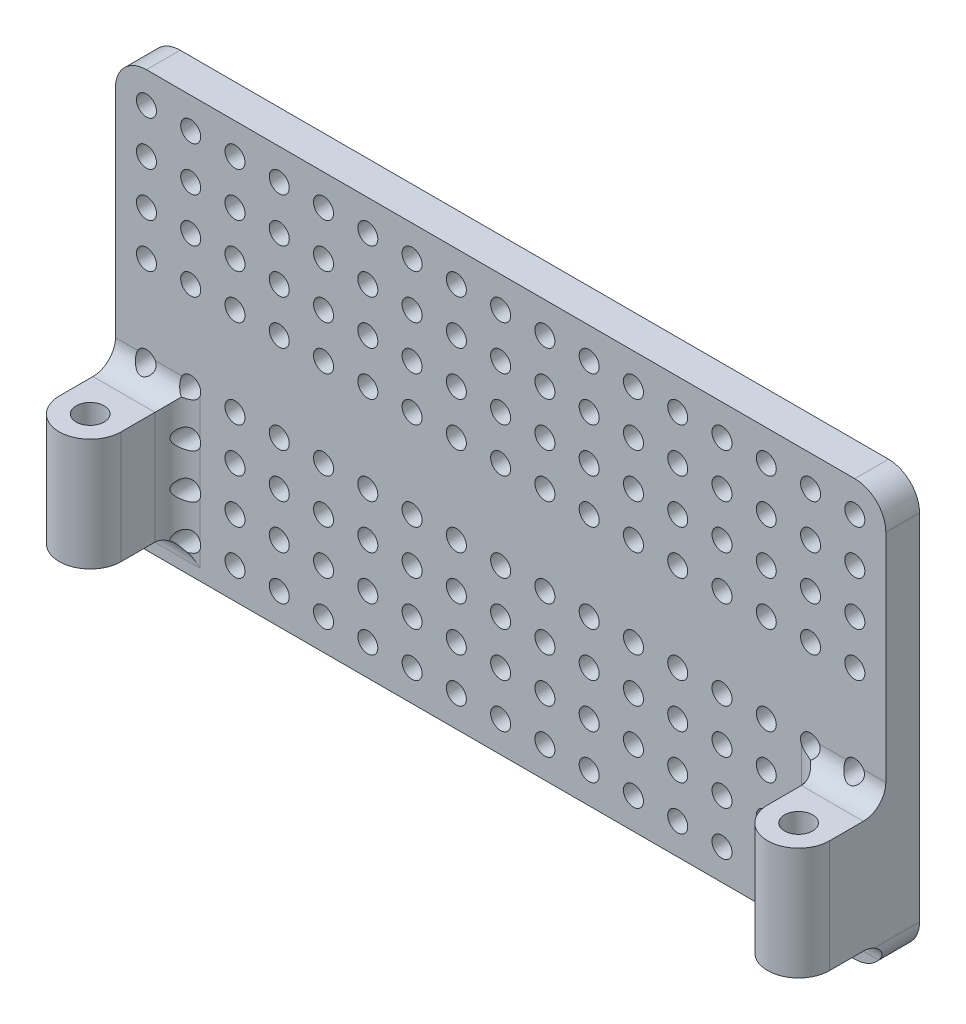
from build123d import *

# Parameters (mm, degrees)
SKETCH1_W                      = 87
SKETCH1_H                      = 47
BOSS_EXTRUDE1_DEPTH            = 1.905
BOSS_EXTRUDE2_DEPTH            = 12.7
F_1_8_0_125_DIAMETER_HOLE1_D   = 3.175
FILLET5_R                      = 2.54
FILLET7_R                      = 3.5
F_4_40_TAPPED_HOLE3_AT_2_COUNT = 2
F_4_40_TAPPED_HOLE3_AT_2_PITCH = 40
F_4_40_TAPPED_HOLE3_AT_3_COUNT = 2
F_4_40_TAPPED_HOLE3_AT_3_PITCH = 25
F_4_40_TAPPED_HOLE3_AT_4_COUNT = 2
F_4_40_TAPPED_HOLE3_AT_4_PITCH = 30
F_4_40_TAPPED_HOLE3_AT_5_COUNT = 2
F_4_40_TAPPED_HOLE3_AT_5_PITCH = 10
F_4_40_TAPPED_HOLE3_AT_6_COUNT = 2
F_4_40_TAPPED_HOLE3_AT_6_PITCH = 15
F_4_40_TAPPED_HOLE3_AT_7_COUNT = 2
F_4_40_TAPPED_HOLE3_AT_7_PITCH = 35
F_4_40_TAPPED_HOLE3_AT_8_COUNT = 2
F_4_40_TAPPED_HOLE3_AT_8_PITCH = 5
LPATTERN2_COUNT                = 17
LPATTERN2_PITCH                = 5


with BuildPart() as part:
    # Sketch1 → Boss-Extrude1 (new, symmetric)
    with BuildSketch(Plane.XY):
        Rectangle(SKETCH1_W, SKETCH1_H)
    extrude(amount=BOSS_EXTRUDE1_DEPTH, both=True)

    # Sketch2 → Boss-Extrude2 (add)
    with BuildSketch(Plane.XZ.offset(19.69)):
        with BuildLine():
            Line((-43.5, 8.255), (-43.5, 1.905))
            Line((-43.5, 1.905), (-36.5, 1.905))
            Line((-36.5, 1.905), (-36.5, 8.255))
            ThreePointArc((-36.5, 8.255), (-40, 11.755), (-43.5, 8.255))
        make_face()
        with BuildLine():
            Line((36.5, 1.905), (36.5, 8.255))
            ThreePointArc((36.5, 8.255), (40, 11.755), (43.5, 8.255))
            Line((43.5, 8.255), (43.5, 1.905))
            Line((43.5, 1.905), (36.5, 1.905))
        make_face()
    extrude(amount=-BOSS_EXTRUDE2_DEPTH)

    # 1_8 _0.125_ Diameter Hole1 (through all)
    with Locations(Plane(origin=(0, -19.69, 0), x_dir=(-1, 0, 0), z_dir=(0, -1, 0))):
        with Locations((40, -8.255), (-40, -8.255)):
            Hole(F_1_8_0_125_DIAMETER_HOLE1_D / 2)

    # Fillet5
    fillet5_edges = [part.edges().sort_by_distance(p)[0] for p in [
        (-40, -6.99, 1.905),
        (-36.5, -13.34, 1.905),
        (-40, -19.69, 1.905),
        (40, -6.99, 1.905),
        (36.5, -13.34, 1.905),
        (40, -19.69, 1.905),
    ]]
    fillet(fillet5_edges, radius=FILLET5_R)

    # Fillet7
    fillet7_edges = [part.edges().sort_by_distance(p)[0] for p in [
        (-43.5, 23.5, 0),
        (43.5, 23.5, 0),
        (43.5, -23.5, 0),
        (-43.5, -23.5, 0),
    ]]
    fillet(fillet7_edges, radius=FILLET7_R)

    # Sketch12 → 4-40 Tapped Hole3 (revolve, cut)
    with BuildSketch(Plane(origin=(40, 20, -1.905), x_dir=(0, 1, 0), z_dir=(1, 0, 0))):
        Polygon((0, 0), (0, 7.029152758), (1.1303, 6.35), (1.1303, 0), align=None)
    f_4_40_tapped_hole3 = revolve(axis=Axis((40, 20, -8.255), (0, 0, 1)), mode=Mode.SUBTRACT)

    # 4-40 Tapped Hole3 at 2: 4-40 Tapped Hole3 ×2
    with Locations(*[(0, -i * F_4_40_TAPPED_HOLE3_AT_2_PITCH, 0) for i in range(1, F_4_40_TAPPED_HOLE3_AT_2_COUNT)]):
        add(f_4_40_tapped_hole3, mode=Mode.SUBTRACT)

    # 4-40 Tapped Hole3 at 3: 4-40 Tapped Hole3 ×2
    with Locations(*[(0, -i * F_4_40_TAPPED_HOLE3_AT_3_PITCH, 0) for i in range(1, F_4_40_TAPPED_HOLE3_AT_3_COUNT)]):
        add(f_4_40_tapped_hole3, mode=Mode.SUBTRACT)

    # 4-40 Tapped Hole3 at 4: 4-40 Tapped Hole3 ×2
    with Locations(*[(0, -i * F_4_40_TAPPED_HOLE3_AT_4_PITCH, 0) for i in range(1, F_4_40_TAPPED_HOLE3_AT_4_COUNT)]):
        add(f_4_40_tapped_hole3, mode=Mode.SUBTRACT)

    # 4-40 Tapped Hole3 at 5: 4-40 Tapped Hole3 ×2
    with Locations(*[(0, -i * F_4_40_TAPPED_HOLE3_AT_5_PITCH, 0) for i in range(1, F_4_40_TAPPED_HOLE3_AT_5_COUNT)]):
        add(f_4_40_tapped_hole3, mode=Mode.SUBTRACT)

    # 4-40 Tapped Hole3 at 6: 4-40 Tapped Hole3 ×2
    with Locations(*[(0, -i * F_4_40_TAPPED_HOLE3_AT_6_PITCH, 0) for i in range(1, F_4_40_TAPPED_HOLE3_AT_6_COUNT)]):
        add(f_4_40_tapped_hole3, mode=Mode.SUBTRACT)

    # 4-40 Tapped Hole3 at 7: 4-40 Tapped Hole3 ×2
    with Locations(*[(0, -i * F_4_40_TAPPED_HOLE3_AT_7_PITCH, 0) for i in range(1, F_4_40_TAPPED_HOLE3_AT_7_COUNT)]):
        add(f_4_40_tapped_hole3, mode=Mode.SUBTRACT)

    # 4-40 Tapped Hole3 at 8: 4-40 Tapped Hole3 ×2
    with Locations(*[(0, -i * F_4_40_TAPPED_HOLE3_AT_8_PITCH, 0) for i in range(1, F_4_40_TAPPED_HOLE3_AT_8_COUNT)]):
        add(f_4_40_tapped_hole3, mode=Mode.SUBTRACT)

    # LPattern2: 4-40 Tapped Hole3 ×17
    with Locations(*[(-i * LPATTERN2_PITCH, 0, 0) for i in range(1, LPATTERN2_COUNT)]):
        add(f_4_40_tapped_hole3, mode=Mode.SUBTRACT)

    # LPattern2 copy 1 sketch → LPattern2 copy 1 (revolve, cut)
    with BuildSketch(Plane(origin=(35, -20, -1.905), x_dir=(0, 1, 0), z_dir=(1, 0, 0))):
        Polygon((0, 0), (0, 7.029152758), (1.1303, 6.35), (1.1303, 0), align=None)
    revolve(axis=Axis((35, -20, -8.255), (0, 0, 1)), mode=Mode.SUBTRACT)

    # LPattern2 copy 2 sketch → LPattern2 copy 2 (revolve, cut)
    with BuildSketch(Plane(origin=(30, -20, -1.905), x_dir=(0, 1, 0), z_dir=(1, 0, 0))):
        Polygon((0, 0), (0, 7.029152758), (1.1303, 6.35), (1.1303, 0), align=None)
    revolve(axis=Axis((30, -20, -8.255), (0, 0, 1)), mode=Mode.SUBTRACT)

    # LPattern2 copy 3 sketch → LPattern2 copy 3 (revolve, cut)
    with BuildSketch(Plane(origin=(25, -20, -1.905), x_dir=(0, 1, 0), z_dir=(1, 0, 0))):
        Polygon((0, 0), (0, 7.029152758), (1.1303, 6.35), (1.1303, 0), align=None)
    revolve(axis=Axis((25, -20, -8.255), (0, 0, 1)), mode=Mode.SUBTRACT)

    # LPattern2 copy 4 sketch → LPattern2 copy 4 (revolve, cut)
    with BuildSketch(Plane(origin=(20, -20, -1.905), x_dir=(0, 1, 0), z_dir=(1, 0, 0))):
        Polygon((0, 0), (0, 7.029152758), (1.1303, 6.35), (1.1303, 0), align=None)
    revolve(axis=Axis((20, -20, -8.255), (0, 0, 1)), mode=Mode.SUBTRACT)

    # LPattern2 copy 5 sketch → LPattern2 copy 5 (revolve, cut)
    with BuildSketch(Plane(origin=(15, -20, -1.905), x_dir=(0, 1, 0), z_dir=(1, 0, 0))):
        Polygon((0, 0), (0, 7.029152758), (1.1303, 6.35), (1.1303, 0), align=None)
    revolve(axis=Axis((15, -20, -8.255), (0, 0, 1)), mode=Mode.SUBTRACT)

    # LPattern2 copy 6 sketch → LPattern2 copy 6 (revolve, cut)
    with BuildSketch(Plane(origin=(10, -20, -1.905), x_dir=(0, 1, 0), z_dir=(1, 0, 0))):
        Polygon((0, 0), (0, 7.029152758), (1.1303, 6.35), (1.1303, 0), align=None)
    revolve(axis=Axis((10, -20, -8.255), (0, 0, 1)), mode=Mode.SUBTRACT)

    # LPattern2 copy 7 sketch → LPattern2 copy 7 (revolve, cut)
    with BuildSketch(Plane(origin=(5, -20, -1.905), x_dir=(0, 1, 0), z_dir=(1, 0, 0))):
        Polygon((0, 0), (0, 7.029152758), (1.1303, 6.35), (1.1303, 0), align=None)
    revolve(axis=Axis((5, -20, -8.255), (0, 0, 1)), mode=Mode.SUBTRACT)

    # LPattern2 copy 8 sketch → LPattern2 copy 8 (revolve, cut)
    with BuildSketch(Plane(origin=(0, -20, -1.905), x_dir=(0, 1, 0), z_dir=(1, 0, 0))):
        Polygon((0, 0), (0, 7.029152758), (1.1303, 6.35), (1.1303, 0), align=None)
    revolve(axis=Axis((0, -20, -8.255), (0, 0, 1)), mode=Mode.SUBTRACT)

    # LPattern2 copy 9 sketch → LPattern2 copy 9 (revolve, cut)
    with BuildSketch(Plane(origin=(-5, -20, -1.905), x_dir=(0, 1, 0), z_dir=(1, 0, 0))):
        Polygon((0, 0), (0, 7.029152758), (1.1303, 6.35), (1.1303, 0), align=None)
    revolve(axis=Axis((-5, -20, -8.255), (0, 0, 1)), mode=Mode.SUBTRACT)

    # LPattern2 copy 10 sketch → LPattern2 copy 10 (revolve, cut)
    with BuildSketch(Plane(origin=(-10, -20, -1.905), x_dir=(0, 1, 0), z_dir=(1, 0, 0))):
        Polygon((0, 0), (0, 7.029152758), (1.1303, 6.35), (1.1303, 0), align=None)
    revolve(axis=Axis((-10, -20, -8.255), (0, 0, 1)), mode=Mode.SUBTRACT)

    # LPattern2 copy 11 sketch → LPattern2 copy 11 (revolve, cut)
    with BuildSketch(Plane(origin=(-15, -20, -1.905), x_dir=(0, 1, 0), z_dir=(1, 0, 0))):
        Polygon((0, 0), (0, 7.029152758), (1.1303, 6.35), (1.1303, 0), align=None)
    revolve(axis=Axis((-15, -20, -8.255), (0, 0, 1)), mode=Mode.SUBTRACT)

    # LPattern2 copy 12 sketch → LPattern2 copy 12 (revolve, cut)
    with BuildSketch(Plane(origin=(-20, -20, -1.905), x_dir=(0, 1, 0), z_dir=(1, 0, 0))):
        Polygon((0, 0), (0, 7.029152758), (1.1303, 6.35), (1.1303, 0), align=None)
    revolve(axis=Axis((-20, -20, -8.255), (0, 0, 1)), mode=Mode.SUBTRACT)

    # LPattern2 copy 13 sketch → LPattern2 copy 13 (revolve, cut)
    with BuildSketch(Plane(origin=(-25, -20, -1.905), x_dir=(0, 1, 0), z_dir=(1, 0, 0))):
        Polygon((0, 0), (0, 7.029152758), (1.1303, 6.35), (1.1303, 0), align=None)
    revolve(axis=Axis((-25, -20, -8.255), (0, 0, 1)), mode=Mode.SUBTRACT)

    # LPattern2 copy 14 sketch → LPattern2 copy 14 (revolve, cut)
    with BuildSketch(Plane(origin=(-30, -20, -1.905), x_dir=(0, 1, 0), z_dir=(1, 0, 0))):
        Polygon((0, 0), (0, 7.029152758), (1.1303, 6.35), (1.1303, 0), align=None)
    revolve(axis=Axis((-30, -20, -8.255), (0, 0, 1)), mode=Mode.SUBTRACT)

    # LPattern2 copy 15 sketch → LPattern2 copy 15 (revolve, cut)
    with BuildSketch(Plane(origin=(-35, -20, -1.905), x_dir=(0, 1, 0), z_dir=(1, 0, 0))):
        Polygon((0, 0), (0, 7.029152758), (1.1303, 6.35), (1.1303, 0), align=None)
    revolve(axis=Axis((-35, -20, -8.255), (0, 0, 1)), mode=Mode.SUBTRACT)

    # LPattern2 copy 16 sketch → LPattern2 copy 16 (revolve, cut)
    with BuildSketch(Plane(origin=(-40, -20, -1.905), x_dir=(0, 1, 0), z_dir=(1, 0, 0))):
        Polygon((0, 0), (0, 7.029152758), (1.1303, 6.35), (1.1303, 0), align=None)
    revolve(axis=Axis((-40, -20, -8.255), (0, 0, 1)), mode=Mode.SUBTRACT)

    # LPattern2 copy 17 sketch → LPattern2 copy 17 (revolve, cut)
    with BuildSketch(Plane(origin=(35, -5, -1.905), x_dir=(0, 1, 0), z_dir=(1, 0, 0))):
        Polygon((0, 0), (0, 7.029152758), (1.1303, 6.35), (1.1303, 0), align=None)
    revolve(axis=Axis((35, -5, -8.255), (0, 0, 1)), mode=Mode.SUBTRACT)

    # LPattern2 copy 18 sketch → LPattern2 copy 18 (revolve, cut)
    with BuildSketch(Plane(origin=(30, -5, -1.905), x_dir=(0, 1, 0), z_dir=(1, 0, 0))):
        Polygon((0, 0), (0, 7.029152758), (1.1303, 6.35), (1.1303, 0), align=None)
    revolve(axis=Axis((30, -5, -8.255), (0, 0, 1)), mode=Mode.SUBTRACT)

    # LPattern2 copy 19 sketch → LPattern2 copy 19 (revolve, cut)
    with BuildSketch(Plane(origin=(25, -5, -1.905), x_dir=(0, 1, 0), z_dir=(1, 0, 0))):
        Polygon((0, 0), (0, 7.029152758), (1.1303, 6.35), (1.1303, 0), align=None)
    revolve(axis=Axis((25, -5, -8.255), (0, 0, 1)), mode=Mode.SUBTRACT)

    # LPattern2 copy 20 sketch → LPattern2 copy 20 (revolve, cut)
    with BuildSketch(Plane(origin=(20, -5, -1.905), x_dir=(0, 1, 0), z_dir=(1, 0, 0))):
        Polygon((0, 0), (0, 7.029152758), (1.1303, 6.35), (1.1303, 0), align=None)
    revolve(axis=Axis((20, -5, -8.255), (0, 0, 1)), mode=Mode.SUBTRACT)

    # LPattern2 copy 21 sketch → LPattern2 copy 21 (revolve, cut)
    with BuildSketch(Plane(origin=(15, -5, -1.905), x_dir=(0, 1, 0), z_dir=(1, 0, 0))):
        Polygon((0, 0), (0, 7.029152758), (1.1303, 6.35), (1.1303, 0), align=None)
    revolve(axis=Axis((15, -5, -8.255), (0, 0, 1)), mode=Mode.SUBTRACT)

    # LPattern2 copy 22 sketch → LPattern2 copy 22 (revolve, cut)
    with BuildSketch(Plane(origin=(10, -5, -1.905), x_dir=(0, 1, 0), z_dir=(1, 0, 0))):
        Polygon((0, 0), (0, 7.029152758), (1.1303, 6.35), (1.1303, 0), align=None)
    revolve(axis=Axis((10, -5, -8.255), (0, 0, 1)), mode=Mode.SUBTRACT)

    # LPattern2 copy 23 sketch → LPattern2 copy 23 (revolve, cut)
    with BuildSketch(Plane(origin=(5, -5, -1.905), x_dir=(0, 1, 0), z_dir=(1, 0, 0))):
        Polygon((0, 0), (0, 7.029152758), (1.1303, 6.35), (1.1303, 0), align=None)
    revolve(axis=Axis((5, -5, -8.255), (0, 0, 1)), mode=Mode.SUBTRACT)

    # LPattern2 copy 24 sketch → LPattern2 copy 24 (revolve, cut)
    with BuildSketch(Plane(origin=(0, -5, -1.905), x_dir=(0, 1, 0), z_dir=(1, 0, 0))):
        Polygon((0, 0), (0, 7.029152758), (1.1303, 6.35), (1.1303, 0), align=None)
    revolve(axis=Axis((0, -5, -8.255), (0, 0, 1)), mode=Mode.SUBTRACT)

    # LPattern2 copy 25 sketch → LPattern2 copy 25 (revolve, cut)
    with BuildSketch(Plane(origin=(-5, -5, -1.905), x_dir=(0, 1, 0), z_dir=(1, 0, 0))):
        Polygon((0, 0), (0, 7.029152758), (1.1303, 6.35), (1.1303, 0), align=None)
    revolve(axis=Axis((-5, -5, -8.255), (0, 0, 1)), mode=Mode.SUBTRACT)

    # LPattern2 copy 26 sketch → LPattern2 copy 26 (revolve, cut)
    with BuildSketch(Plane(origin=(-10, -5, -1.905), x_dir=(0, 1, 0), z_dir=(1, 0, 0))):
        Polygon((0, 0), (0, 7.029152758), (1.1303, 6.35), (1.1303, 0), align=None)
    revolve(axis=Axis((-10, -5, -8.255), (0, 0, 1)), mode=Mode.SUBTRACT)

    # LPattern2 copy 27 sketch → LPattern2 copy 27 (revolve, cut)
    with BuildSketch(Plane(origin=(-15, -5, -1.905), x_dir=(0, 1, 0), z_dir=(1, 0, 0))):
        Polygon((0, 0), (0, 7.029152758), (1.1303, 6.35), (1.1303, 0), align=None)
    revolve(axis=Axis((-15, -5, -8.255), (0, 0, 1)), mode=Mode.SUBTRACT)

    # LPattern2 copy 28 sketch → LPattern2 copy 28 (revolve, cut)
    with BuildSketch(Plane(origin=(-20, -5, -1.905), x_dir=(0, 1, 0), z_dir=(1, 0, 0))):
        Polygon((0, 0), (0, 7.029152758), (1.1303, 6.35), (1.1303, 0), align=None)
    revolve(axis=Axis((-20, -5, -8.255), (0, 0, 1)), mode=Mode.SUBTRACT)

    # LPattern2 copy 29 sketch → LPattern2 copy 29 (revolve, cut)
    with BuildSketch(Plane(origin=(-25, -5, -1.905), x_dir=(0, 1, 0), z_dir=(1, 0, 0))):
        Polygon((0, 0), (0, 7.029152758), (1.1303, 6.35), (1.1303, 0), align=None)
    revolve(axis=Axis((-25, -5, -8.255), (0, 0, 1)), mode=Mode.SUBTRACT)

    # LPattern2 copy 30 sketch → LPattern2 copy 30 (revolve, cut)
    with BuildSketch(Plane(origin=(-30, -5, -1.905), x_dir=(0, 1, 0), z_dir=(1, 0, 0))):
        Polygon((0, 0), (0, 7.029152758), (1.1303, 6.35), (1.1303, 0), align=None)
    revolve(axis=Axis((-30, -5, -8.255), (0, 0, 1)), mode=Mode.SUBTRACT)

    # LPattern2 copy 31 sketch → LPattern2 copy 31 (revolve, cut)
    with BuildSketch(Plane(origin=(-35, -5, -1.905), x_dir=(0, 1, 0), z_dir=(1, 0, 0))):
        Polygon((0, 0), (0, 7.029152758), (1.1303, 6.35), (1.1303, 0), align=None)
    revolve(axis=Axis((-35, -5, -8.255), (0, 0, 1)), mode=Mode.SUBTRACT)

    # LPattern2 copy 32 sketch → LPattern2 copy 32 (revolve, cut)
    with BuildSketch(Plane(origin=(-40, -5, -1.905), x_dir=(0, 1, 0), z_dir=(1, 0, 0))):
        Polygon((0, 0), (0, 7.029152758), (1.1303, 6.35), (1.1303, 0), align=None)
    revolve(axis=Axis((-40, -5, -8.255), (0, 0, 1)), mode=Mode.SUBTRACT)

    # LPattern2 copy 33 sketch → LPattern2 copy 33 (revolve, cut)
    with BuildSketch(Plane(origin=(35, -10, -1.905), x_dir=(0, 1, 0), z_dir=(1, 0, 0))):
        Polygon((0, 0), (0, 7.029152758), (1.1303, 6.35), (1.1303, 0), align=None)
    revolve(axis=Axis((35, -10, -8.255), (0, 0, 1)), mode=Mode.SUBTRACT)

    # LPattern2 copy 34 sketch → LPattern2 copy 34 (revolve, cut)
    with BuildSketch(Plane(origin=(30, -10, -1.905), x_dir=(0, 1, 0), z_dir=(1, 0, 0))):
        Polygon((0, 0), (0, 7.029152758), (1.1303, 6.35), (1.1303, 0), align=None)
    revolve(axis=Axis((30, -10, -8.255), (0, 0, 1)), mode=Mode.SUBTRACT)

    # LPattern2 copy 35 sketch → LPattern2 copy 35 (revolve, cut)
    with BuildSketch(Plane(origin=(25, -10, -1.905), x_dir=(0, 1, 0), z_dir=(1, 0, 0))):
        Polygon((0, 0), (0, 7.029152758), (1.1303, 6.35), (1.1303, 0), align=None)
    revolve(axis=Axis((25, -10, -8.255), (0, 0, 1)), mode=Mode.SUBTRACT)

    # LPattern2 copy 36 sketch → LPattern2 copy 36 (revolve, cut)
    with BuildSketch(Plane(origin=(20, -10, -1.905), x_dir=(0, 1, 0), z_dir=(1, 0, 0))):
        Polygon((0, 0), (0, 7.029152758), (1.1303, 6.35), (1.1303, 0), align=None)
    revolve(axis=Axis((20, -10, -8.255), (0, 0, 1)), mode=Mode.SUBTRACT)

    # LPattern2 copy 37 sketch → LPattern2 copy 37 (revolve, cut)
    with BuildSketch(Plane(origin=(15, -10, -1.905), x_dir=(0, 1, 0), z_dir=(1, 0, 0))):
        Polygon((0, 0), (0, 7.029152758), (1.1303, 6.35), (1.1303, 0), align=None)
    revolve(axis=Axis((15, -10, -8.255), (0, 0, 1)), mode=Mode.SUBTRACT)

    # LPattern2 copy 38 sketch → LPattern2 copy 38 (revolve, cut)
    with BuildSketch(Plane(origin=(10, -10, -1.905), x_dir=(0, 1, 0), z_dir=(1, 0, 0))):
        Polygon((0, 0), (0, 7.029152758), (1.1303, 6.35), (1.1303, 0), align=None)
    revolve(axis=Axis((10, -10, -8.255), (0, 0, 1)), mode=Mode.SUBTRACT)

    # LPattern2 copy 39 sketch → LPattern2 copy 39 (revolve, cut)
    with BuildSketch(Plane(origin=(5, -10, -1.905), x_dir=(0, 1, 0), z_dir=(1, 0, 0))):
        Polygon((0, 0), (0, 7.029152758), (1.1303, 6.35), (1.1303, 0), align=None)
    revolve(axis=Axis((5, -10, -8.255), (0, 0, 1)), mode=Mode.SUBTRACT)

    # LPattern2 copy 40 sketch → LPattern2 copy 40 (revolve, cut)
    with BuildSketch(Plane(origin=(0, -10, -1.905), x_dir=(0, 1, 0), z_dir=(1, 0, 0))):
        Polygon((0, 0), (0, 7.029152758), (1.1303, 6.35), (1.1303, 0), align=None)
    revolve(axis=Axis((0, -10, -8.255), (0, 0, 1)), mode=Mode.SUBTRACT)

    # LPattern2 copy 41 sketch → LPattern2 copy 41 (revolve, cut)
    with BuildSketch(Plane(origin=(-5, -10, -1.905), x_dir=(0, 1, 0), z_dir=(1, 0, 0))):
        Polygon((0, 0), (0, 7.029152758), (1.1303, 6.35), (1.1303, 0), align=None)
    revolve(axis=Axis((-5, -10, -8.255), (0, 0, 1)), mode=Mode.SUBTRACT)

    # LPattern2 copy 42 sketch → LPattern2 copy 42 (revolve, cut)
    with BuildSketch(Plane(origin=(-10, -10, -1.905), x_dir=(0, 1, 0), z_dir=(1, 0, 0))):
        Polygon((0, 0), (0, 7.029152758), (1.1303, 6.35), (1.1303, 0), align=None)
    revolve(axis=Axis((-10, -10, -8.255), (0, 0, 1)), mode=Mode.SUBTRACT)

    # LPattern2 copy 43 sketch → LPattern2 copy 43 (revolve, cut)
    with BuildSketch(Plane(origin=(-15, -10, -1.905), x_dir=(0, 1, 0), z_dir=(1, 0, 0))):
        Polygon((0, 0), (0, 7.029152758), (1.1303, 6.35), (1.1303, 0), align=None)
    revolve(axis=Axis((-15, -10, -8.255), (0, 0, 1)), mode=Mode.SUBTRACT)

    # LPattern2 copy 44 sketch → LPattern2 copy 44 (revolve, cut)
    with BuildSketch(Plane(origin=(-20, -10, -1.905), x_dir=(0, 1, 0), z_dir=(1, 0, 0))):
        Polygon((0, 0), (0, 7.029152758), (1.1303, 6.35), (1.1303, 0), align=None)
    revolve(axis=Axis((-20, -10, -8.255), (0, 0, 1)), mode=Mode.SUBTRACT)

    # LPattern2 copy 45 sketch → LPattern2 copy 45 (revolve, cut)
    with BuildSketch(Plane(origin=(-25, -10, -1.905), x_dir=(0, 1, 0), z_dir=(1, 0, 0))):
        Polygon((0, 0), (0, 7.029152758), (1.1303, 6.35), (1.1303, 0), align=None)
    revolve(axis=Axis((-25, -10, -8.255), (0, 0, 1)), mode=Mode.SUBTRACT)

    # LPattern2 copy 46 sketch → LPattern2 copy 46 (revolve, cut)
    with BuildSketch(Plane(origin=(-30, -10, -1.905), x_dir=(0, 1, 0), z_dir=(1, 0, 0))):
        Polygon((0, 0), (0, 7.029152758), (1.1303, 6.35), (1.1303, 0), align=None)
    revolve(axis=Axis((-30, -10, -8.255), (0, 0, 1)), mode=Mode.SUBTRACT)

    # LPattern2 copy 47 sketch → LPattern2 copy 47 (revolve, cut)
    with BuildSketch(Plane(origin=(-35, -10, -1.905), x_dir=(0, 1, 0), z_dir=(1, 0, 0))):
        Polygon((0, 0), (0, 7.029152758), (1.1303, 6.35), (1.1303, 0), align=None)
    revolve(axis=Axis((-35, -10, -8.255), (0, 0, 1)), mode=Mode.SUBTRACT)

    # LPattern2 copy 48 sketch → LPattern2 copy 48 (revolve, cut)
    with BuildSketch(Plane(origin=(-40, -10, -1.905), x_dir=(0, 1, 0), z_dir=(1, 0, 0))):
        Polygon((0, 0), (0, 7.029152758), (1.1303, 6.35), (1.1303, 0), align=None)
    revolve(axis=Axis((-40, -10, -8.255), (0, 0, 1)), mode=Mode.SUBTRACT)

    # LPattern2 copy 49 sketch → LPattern2 copy 49 (revolve, cut)
    with BuildSketch(Plane(origin=(35, 10, -1.905), x_dir=(0, 1, 0), z_dir=(1, 0, 0))):
        Polygon((0, 0), (0, 7.029152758), (1.1303, 6.35), (1.1303, 0), align=None)
    revolve(axis=Axis((35, 10, -8.255), (0, 0, 1)), mode=Mode.SUBTRACT)

    # LPattern2 copy 50 sketch → LPattern2 copy 50 (revolve, cut)
    with BuildSketch(Plane(origin=(30, 10, -1.905), x_dir=(0, 1, 0), z_dir=(1, 0, 0))):
        Polygon((0, 0), (0, 7.029152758), (1.1303, 6.35), (1.1303, 0), align=None)
    revolve(axis=Axis((30, 10, -8.255), (0, 0, 1)), mode=Mode.SUBTRACT)

    # LPattern2 copy 51 sketch → LPattern2 copy 51 (revolve, cut)
    with BuildSketch(Plane(origin=(25, 10, -1.905), x_dir=(0, 1, 0), z_dir=(1, 0, 0))):
        Polygon((0, 0), (0, 7.029152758), (1.1303, 6.35), (1.1303, 0), align=None)
    revolve(axis=Axis((25, 10, -8.255), (0, 0, 1)), mode=Mode.SUBTRACT)

    # LPattern2 copy 52 sketch → LPattern2 copy 52 (revolve, cut)
    with BuildSketch(Plane(origin=(20, 10, -1.905), x_dir=(0, 1, 0), z_dir=(1, 0, 0))):
        Polygon((0, 0), (0, 7.029152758), (1.1303, 6.35), (1.1303, 0), align=None)
    revolve(axis=Axis((20, 10, -8.255), (0, 0, 1)), mode=Mode.SUBTRACT)

    # LPattern2 copy 53 sketch → LPattern2 copy 53 (revolve, cut)
    with BuildSketch(Plane(origin=(15, 10, -1.905), x_dir=(0, 1, 0), z_dir=(1, 0, 0))):
        Polygon((0, 0), (0, 7.029152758), (1.1303, 6.35), (1.1303, 0), align=None)
    revolve(axis=Axis((15, 10, -8.255), (0, 0, 1)), mode=Mode.SUBTRACT)

    # LPattern2 copy 54 sketch → LPattern2 copy 54 (revolve, cut)
    with BuildSketch(Plane(origin=(10, 10, -1.905), x_dir=(0, 1, 0), z_dir=(1, 0, 0))):
        Polygon((0, 0), (0, 7.029152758), (1.1303, 6.35), (1.1303, 0), align=None)
    revolve(axis=Axis((10, 10, -8.255), (0, 0, 1)), mode=Mode.SUBTRACT)

    # LPattern2 copy 55 sketch → LPattern2 copy 55 (revolve, cut)
    with BuildSketch(Plane(origin=(5, 10, -1.905), x_dir=(0, 1, 0), z_dir=(1, 0, 0))):
        Polygon((0, 0), (0, 7.029152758), (1.1303, 6.35), (1.1303, 0), align=None)
    revolve(axis=Axis((5, 10, -8.255), (0, 0, 1)), mode=Mode.SUBTRACT)

    # LPattern2 copy 56 sketch → LPattern2 copy 56 (revolve, cut)
    with BuildSketch(Plane(origin=(0, 10, -1.905), x_dir=(0, 1, 0), z_dir=(1, 0, 0))):
        Polygon((0, 0), (0, 7.029152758), (1.1303, 6.35), (1.1303, 0), align=None)
    revolve(axis=Axis((0, 10, -8.255), (0, 0, 1)), mode=Mode.SUBTRACT)

    # LPattern2 copy 57 sketch → LPattern2 copy 57 (revolve, cut)
    with BuildSketch(Plane(origin=(-5, 10, -1.905), x_dir=(0, 1, 0), z_dir=(1, 0, 0))):
        Polygon((0, 0), (0, 7.029152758), (1.1303, 6.35), (1.1303, 0), align=None)
    revolve(axis=Axis((-5, 10, -8.255), (0, 0, 1)), mode=Mode.SUBTRACT)

    # LPattern2 copy 58 sketch → LPattern2 copy 58 (revolve, cut)
    with BuildSketch(Plane(origin=(-10, 10, -1.905), x_dir=(0, 1, 0), z_dir=(1, 0, 0))):
        Polygon((0, 0), (0, 7.029152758), (1.1303, 6.35), (1.1303, 0), align=None)
    revolve(axis=Axis((-10, 10, -8.255), (0, 0, 1)), mode=Mode.SUBTRACT)

    # LPattern2 copy 59 sketch → LPattern2 copy 59 (revolve, cut)
    with BuildSketch(Plane(origin=(-15, 10, -1.905), x_dir=(0, 1, 0), z_dir=(1, 0, 0))):
        Polygon((0, 0), (0, 7.029152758), (1.1303, 6.35), (1.1303, 0), align=None)
    revolve(axis=Axis((-15, 10, -8.255), (0, 0, 1)), mode=Mode.SUBTRACT)

    # LPattern2 copy 60 sketch → LPattern2 copy 60 (revolve, cut)
    with BuildSketch(Plane(origin=(-20, 10, -1.905), x_dir=(0, 1, 0), z_dir=(1, 0, 0))):
        Polygon((0, 0), (0, 7.029152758), (1.1303, 6.35), (1.1303, 0), align=None)
    revolve(axis=Axis((-20, 10, -8.255), (0, 0, 1)), mode=Mode.SUBTRACT)

    # LPattern2 copy 61 sketch → LPattern2 copy 61 (revolve, cut)
    with BuildSketch(Plane(origin=(-25, 10, -1.905), x_dir=(0, 1, 0), z_dir=(1, 0, 0))):
        Polygon((0, 0), (0, 7.029152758), (1.1303, 6.35), (1.1303, 0), align=None)
    revolve(axis=Axis((-25, 10, -8.255), (0, 0, 1)), mode=Mode.SUBTRACT)

    # LPattern2 copy 62 sketch → LPattern2 copy 62 (revolve, cut)
    with BuildSketch(Plane(origin=(-30, 10, -1.905), x_dir=(0, 1, 0), z_dir=(1, 0, 0))):
        Polygon((0, 0), (0, 7.029152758), (1.1303, 6.35), (1.1303, 0), align=None)
    revolve(axis=Axis((-30, 10, -8.255), (0, 0, 1)), mode=Mode.SUBTRACT)

    # LPattern2 copy 63 sketch → LPattern2 copy 63 (revolve, cut)
    with BuildSketch(Plane(origin=(-35, 10, -1.905), x_dir=(0, 1, 0), z_dir=(1, 0, 0))):
        Polygon((0, 0), (0, 7.029152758), (1.1303, 6.35), (1.1303, 0), align=None)
    revolve(axis=Axis((-35, 10, -8.255), (0, 0, 1)), mode=Mode.SUBTRACT)

    # LPattern2 copy 64 sketch → LPattern2 copy 64 (revolve, cut)
    with BuildSketch(Plane(origin=(-40, 10, -1.905), x_dir=(0, 1, 0), z_dir=(1, 0, 0))):
        Polygon((0, 0), (0, 7.029152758), (1.1303, 6.35), (1.1303, 0), align=None)
    revolve(axis=Axis((-40, 10, -8.255), (0, 0, 1)), mode=Mode.SUBTRACT)

    # LPattern2 copy 65 sketch → LPattern2 copy 65 (revolve, cut)
    with BuildSketch(Plane(origin=(35, 5, -1.905), x_dir=(0, 1, 0), z_dir=(1, 0, 0))):
        Polygon((0, 0), (0, 7.029152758), (1.1303, 6.35), (1.1303, 0), align=None)
    revolve(axis=Axis((35, 5, -8.255), (0, 0, 1)), mode=Mode.SUBTRACT)

    # LPattern2 copy 66 sketch → LPattern2 copy 66 (revolve, cut)
    with BuildSketch(Plane(origin=(30, 5, -1.905), x_dir=(0, 1, 0), z_dir=(1, 0, 0))):
        Polygon((0, 0), (0, 7.029152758), (1.1303, 6.35), (1.1303, 0), align=None)
    revolve(axis=Axis((30, 5, -8.255), (0, 0, 1)), mode=Mode.SUBTRACT)

    # LPattern2 copy 67 sketch → LPattern2 copy 67 (revolve, cut)
    with BuildSketch(Plane(origin=(25, 5, -1.905), x_dir=(0, 1, 0), z_dir=(1, 0, 0))):
        Polygon((0, 0), (0, 7.029152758), (1.1303, 6.35), (1.1303, 0), align=None)
    revolve(axis=Axis((25, 5, -8.255), (0, 0, 1)), mode=Mode.SUBTRACT)

    # LPattern2 copy 68 sketch → LPattern2 copy 68 (revolve, cut)
    with BuildSketch(Plane(origin=(20, 5, -1.905), x_dir=(0, 1, 0), z_dir=(1, 0, 0))):
        Polygon((0, 0), (0, 7.029152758), (1.1303, 6.35), (1.1303, 0), align=None)
    revolve(axis=Axis((20, 5, -8.255), (0, 0, 1)), mode=Mode.SUBTRACT)

    # LPattern2 copy 69 sketch → LPattern2 copy 69 (revolve, cut)
    with BuildSketch(Plane(origin=(15, 5, -1.905), x_dir=(0, 1, 0), z_dir=(1, 0, 0))):
        Polygon((0, 0), (0, 7.029152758), (1.1303, 6.35), (1.1303, 0), align=None)
    revolve(axis=Axis((15, 5, -8.255), (0, 0, 1)), mode=Mode.SUBTRACT)

    # LPattern2 copy 70 sketch → LPattern2 copy 70 (revolve, cut)
    with BuildSketch(Plane(origin=(10, 5, -1.905), x_dir=(0, 1, 0), z_dir=(1, 0, 0))):
        Polygon((0, 0), (0, 7.029152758), (1.1303, 6.35), (1.1303, 0), align=None)
    revolve(axis=Axis((10, 5, -8.255), (0, 0, 1)), mode=Mode.SUBTRACT)

    # LPattern2 copy 71 sketch → LPattern2 copy 71 (revolve, cut)
    with BuildSketch(Plane(origin=(5, 5, -1.905), x_dir=(0, 1, 0), z_dir=(1, 0, 0))):
        Polygon((0, 0), (0, 7.029152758), (1.1303, 6.35), (1.1303, 0), align=None)
    revolve(axis=Axis((5, 5, -8.255), (0, 0, 1)), mode=Mode.SUBTRACT)

    # LPattern2 copy 72 sketch → LPattern2 copy 72 (revolve, cut)
    with BuildSketch(Plane(origin=(0, 5, -1.905), x_dir=(0, 1, 0), z_dir=(1, 0, 0))):
        Polygon((0, 0), (0, 7.029152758), (1.1303, 6.35), (1.1303, 0), align=None)
    revolve(axis=Axis((0, 5, -8.255), (0, 0, 1)), mode=Mode.SUBTRACT)

    # LPattern2 copy 73 sketch → LPattern2 copy 73 (revolve, cut)
    with BuildSketch(Plane(origin=(-5, 5, -1.905), x_dir=(0, 1, 0), z_dir=(1, 0, 0))):
        Polygon((0, 0), (0, 7.029152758), (1.1303, 6.35), (1.1303, 0), align=None)
    revolve(axis=Axis((-5, 5, -8.255), (0, 0, 1)), mode=Mode.SUBTRACT)

    # LPattern2 copy 74 sketch → LPattern2 copy 74 (revolve, cut)
    with BuildSketch(Plane(origin=(-10, 5, -1.905), x_dir=(0, 1, 0), z_dir=(1, 0, 0))):
        Polygon((0, 0), (0, 7.029152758), (1.1303, 6.35), (1.1303, 0), align=None)
    revolve(axis=Axis((-10, 5, -8.255), (0, 0, 1)), mode=Mode.SUBTRACT)

    # LPattern2 copy 75 sketch → LPattern2 copy 75 (revolve, cut)
    with BuildSketch(Plane(origin=(-15, 5, -1.905), x_dir=(0, 1, 0), z_dir=(1, 0, 0))):
        Polygon((0, 0), (0, 7.029152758), (1.1303, 6.35), (1.1303, 0), align=None)
    revolve(axis=Axis((-15, 5, -8.255), (0, 0, 1)), mode=Mode.SUBTRACT)

    # LPattern2 copy 76 sketch → LPattern2 copy 76 (revolve, cut)
    with BuildSketch(Plane(origin=(-20, 5, -1.905), x_dir=(0, 1, 0), z_dir=(1, 0, 0))):
        Polygon((0, 0), (0, 7.029152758), (1.1303, 6.35), (1.1303, 0), align=None)
    revolve(axis=Axis((-20, 5, -8.255), (0, 0, 1)), mode=Mode.SUBTRACT)

    # LPattern2 copy 77 sketch → LPattern2 copy 77 (revolve, cut)
    with BuildSketch(Plane(origin=(-25, 5, -1.905), x_dir=(0, 1, 0), z_dir=(1, 0, 0))):
        Polygon((0, 0), (0, 7.029152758), (1.1303, 6.35), (1.1303, 0), align=None)
    revolve(axis=Axis((-25, 5, -8.255), (0, 0, 1)), mode=Mode.SUBTRACT)

    # LPattern2 copy 78 sketch → LPattern2 copy 78 (revolve, cut)
    with BuildSketch(Plane(origin=(-30, 5, -1.905), x_dir=(0, 1, 0), z_dir=(1, 0, 0))):
        Polygon((0, 0), (0, 7.029152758), (1.1303, 6.35), (1.1303, 0), align=None)
    revolve(axis=Axis((-30, 5, -8.255), (0, 0, 1)), mode=Mode.SUBTRACT)

    # LPattern2 copy 79 sketch → LPattern2 copy 79 (revolve, cut)
    with BuildSketch(Plane(origin=(-35, 5, -1.905), x_dir=(0, 1, 0), z_dir=(1, 0, 0))):
        Polygon((0, 0), (0, 7.029152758), (1.1303, 6.35), (1.1303, 0), align=None)
    revolve(axis=Axis((-35, 5, -8.255), (0, 0, 1)), mode=Mode.SUBTRACT)

    # LPattern2 copy 80 sketch → LPattern2 copy 80 (revolve, cut)
    with BuildSketch(Plane(origin=(-40, 5, -1.905), x_dir=(0, 1, 0), z_dir=(1, 0, 0))):
        Polygon((0, 0), (0, 7.029152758), (1.1303, 6.35), (1.1303, 0), align=None)
    revolve(axis=Axis((-40, 5, -8.255), (0, 0, 1)), mode=Mode.SUBTRACT)

    # LPattern2 copy 81 sketch → LPattern2 copy 81 (revolve, cut)
    with BuildSketch(Plane(origin=(35, -15, -1.905), x_dir=(0, 1, 0), z_dir=(1, 0, 0))):
        Polygon((0, 0), (0, 7.029152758), (1.1303, 6.35), (1.1303, 0), align=None)
    revolve(axis=Axis((35, -15, -8.255), (0, 0, 1)), mode=Mode.SUBTRACT)

    # LPattern2 copy 82 sketch → LPattern2 copy 82 (revolve, cut)
    with BuildSketch(Plane(origin=(30, -15, -1.905), x_dir=(0, 1, 0), z_dir=(1, 0, 0))):
        Polygon((0, 0), (0, 7.029152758), (1.1303, 6.35), (1.1303, 0), align=None)
    revolve(axis=Axis((30, -15, -8.255), (0, 0, 1)), mode=Mode.SUBTRACT)

    # LPattern2 copy 83 sketch → LPattern2 copy 83 (revolve, cut)
    with BuildSketch(Plane(origin=(25, -15, -1.905), x_dir=(0, 1, 0), z_dir=(1, 0, 0))):
        Polygon((0, 0), (0, 7.029152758), (1.1303, 6.35), (1.1303, 0), align=None)
    revolve(axis=Axis((25, -15, -8.255), (0, 0, 1)), mode=Mode.SUBTRACT)

    # LPattern2 copy 84 sketch → LPattern2 copy 84 (revolve, cut)
    with BuildSketch(Plane(origin=(20, -15, -1.905), x_dir=(0, 1, 0), z_dir=(1, 0, 0))):
        Polygon((0, 0), (0, 7.029152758), (1.1303, 6.35), (1.1303, 0), align=None)
    revolve(axis=Axis((20, -15, -8.255), (0, 0, 1)), mode=Mode.SUBTRACT)

    # LPattern2 copy 85 sketch → LPattern2 copy 85 (revolve, cut)
    with BuildSketch(Plane(origin=(15, -15, -1.905), x_dir=(0, 1, 0), z_dir=(1, 0, 0))):
        Polygon((0, 0), (0, 7.029152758), (1.1303, 6.35), (1.1303, 0), align=None)
    revolve(axis=Axis((15, -15, -8.255), (0, 0, 1)), mode=Mode.SUBTRACT)

    # LPattern2 copy 86 sketch → LPattern2 copy 86 (revolve, cut)
    with BuildSketch(Plane(origin=(10, -15, -1.905), x_dir=(0, 1, 0), z_dir=(1, 0, 0))):
        Polygon((0, 0), (0, 7.029152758), (1.1303, 6.35), (1.1303, 0), align=None)
    revolve(axis=Axis((10, -15, -8.255), (0, 0, 1)), mode=Mode.SUBTRACT)

    # LPattern2 copy 87 sketch → LPattern2 copy 87 (revolve, cut)
    with BuildSketch(Plane(origin=(5, -15, -1.905), x_dir=(0, 1, 0), z_dir=(1, 0, 0))):
        Polygon((0, 0), (0, 7.029152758), (1.1303, 6.35), (1.1303, 0), align=None)
    revolve(axis=Axis((5, -15, -8.255), (0, 0, 1)), mode=Mode.SUBTRACT)

    # LPattern2 copy 88 sketch → LPattern2 copy 88 (revolve, cut)
    with BuildSketch(Plane(origin=(0, -15, -1.905), x_dir=(0, 1, 0), z_dir=(1, 0, 0))):
        Polygon((0, 0), (0, 7.029152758), (1.1303, 6.35), (1.1303, 0), align=None)
    revolve(axis=Axis((0, -15, -8.255), (0, 0, 1)), mode=Mode.SUBTRACT)

    # LPattern2 copy 89 sketch → LPattern2 copy 89 (revolve, cut)
    with BuildSketch(Plane(origin=(-5, -15, -1.905), x_dir=(0, 1, 0), z_dir=(1, 0, 0))):
        Polygon((0, 0), (0, 7.029152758), (1.1303, 6.35), (1.1303, 0), align=None)
    revolve(axis=Axis((-5, -15, -8.255), (0, 0, 1)), mode=Mode.SUBTRACT)

    # LPattern2 copy 90 sketch → LPattern2 copy 90 (revolve, cut)
    with BuildSketch(Plane(origin=(-10, -15, -1.905), x_dir=(0, 1, 0), z_dir=(1, 0, 0))):
        Polygon((0, 0), (0, 7.029152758), (1.1303, 6.35), (1.1303, 0), align=None)
    revolve(axis=Axis((-10, -15, -8.255), (0, 0, 1)), mode=Mode.SUBTRACT)

    # LPattern2 copy 91 sketch → LPattern2 copy 91 (revolve, cut)
    with BuildSketch(Plane(origin=(-15, -15, -1.905), x_dir=(0, 1, 0), z_dir=(1, 0, 0))):
        Polygon((0, 0), (0, 7.029152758), (1.1303, 6.35), (1.1303, 0), align=None)
    revolve(axis=Axis((-15, -15, -8.255), (0, 0, 1)), mode=Mode.SUBTRACT)

    # LPattern2 copy 92 sketch → LPattern2 copy 92 (revolve, cut)
    with BuildSketch(Plane(origin=(-20, -15, -1.905), x_dir=(0, 1, 0), z_dir=(1, 0, 0))):
        Polygon((0, 0), (0, 7.029152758), (1.1303, 6.35), (1.1303, 0), align=None)
    revolve(axis=Axis((-20, -15, -8.255), (0, 0, 1)), mode=Mode.SUBTRACT)

    # LPattern2 copy 93 sketch → LPattern2 copy 93 (revolve, cut)
    with BuildSketch(Plane(origin=(-25, -15, -1.905), x_dir=(0, 1, 0), z_dir=(1, 0, 0))):
        Polygon((0, 0), (0, 7.029152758), (1.1303, 6.35), (1.1303, 0), align=None)
    revolve(axis=Axis((-25, -15, -8.255), (0, 0, 1)), mode=Mode.SUBTRACT)

    # LPattern2 copy 94 sketch → LPattern2 copy 94 (revolve, cut)
    with BuildSketch(Plane(origin=(-30, -15, -1.905), x_dir=(0, 1, 0), z_dir=(1, 0, 0))):
        Polygon((0, 0), (0, 7.029152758), (1.1303, 6.35), (1.1303, 0), align=None)
    revolve(axis=Axis((-30, -15, -8.255), (0, 0, 1)), mode=Mode.SUBTRACT)

    # LPattern2 copy 95 sketch → LPattern2 copy 95 (revolve, cut)
    with BuildSketch(Plane(origin=(-35, -15, -1.905), x_dir=(0, 1, 0), z_dir=(1, 0, 0))):
        Polygon((0, 0), (0, 7.029152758), (1.1303, 6.35), (1.1303, 0), align=None)
    revolve(axis=Axis((-35, -15, -8.255), (0, 0, 1)), mode=Mode.SUBTRACT)

    # LPattern2 copy 96 sketch → LPattern2 copy 96 (revolve, cut)
    with BuildSketch(Plane(origin=(-40, -15, -1.905), x_dir=(0, 1, 0), z_dir=(1, 0, 0))):
        Polygon((0, 0), (0, 7.029152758), (1.1303, 6.35), (1.1303, 0), align=None)
    revolve(axis=Axis((-40, -15, -8.255), (0, 0, 1)), mode=Mode.SUBTRACT)

    # LPattern2 copy 97 sketch → LPattern2 copy 97 (revolve, cut)
    with BuildSketch(Plane(origin=(35, 15, -1.905), x_dir=(0, 1, 0), z_dir=(1, 0, 0))):
        Polygon((0, 0), (0, 7.029152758), (1.1303, 6.35), (1.1303, 0), align=None)
    revolve(axis=Axis((35, 15, -8.255), (0, 0, 1)), mode=Mode.SUBTRACT)

    # LPattern2 copy 98 sketch → LPattern2 copy 98 (revolve, cut)
    with BuildSketch(Plane(origin=(30, 15, -1.905), x_dir=(0, 1, 0), z_dir=(1, 0, 0))):
        Polygon((0, 0), (0, 7.029152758), (1.1303, 6.35), (1.1303, 0), align=None)
    revolve(axis=Axis((30, 15, -8.255), (0, 0, 1)), mode=Mode.SUBTRACT)

    # LPattern2 copy 99 sketch → LPattern2 copy 99 (revolve, cut)
    with BuildSketch(Plane(origin=(25, 15, -1.905), x_dir=(0, 1, 0), z_dir=(1, 0, 0))):
        Polygon((0, 0), (0, 7.029152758), (1.1303, 6.35), (1.1303, 0), align=None)
    revolve(axis=Axis((25, 15, -8.255), (0, 0, 1)), mode=Mode.SUBTRACT)

    # LPattern2 copy 100 sketch → LPattern2 copy 100 (revolve, cut)
    with BuildSketch(Plane(origin=(20, 15, -1.905), x_dir=(0, 1, 0), z_dir=(1, 0, 0))):
        Polygon((0, 0), (0, 7.029152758), (1.1303, 6.35), (1.1303, 0), align=None)
    revolve(axis=Axis((20, 15, -8.255), (0, 0, 1)), mode=Mode.SUBTRACT)

    # LPattern2 copy 101 sketch → LPattern2 copy 101 (revolve, cut)
    with BuildSketch(Plane(origin=(15, 15, -1.905), x_dir=(0, 1, 0), z_dir=(1, 0, 0))):
        Polygon((0, 0), (0, 7.029152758), (1.1303, 6.35), (1.1303, 0), align=None)
    revolve(axis=Axis((15, 15, -8.255), (0, 0, 1)), mode=Mode.SUBTRACT)

    # LPattern2 copy 102 sketch → LPattern2 copy 102 (revolve, cut)
    with BuildSketch(Plane(origin=(10, 15, -1.905), x_dir=(0, 1, 0), z_dir=(1, 0, 0))):
        Polygon((0, 0), (0, 7.029152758), (1.1303, 6.35), (1.1303, 0), align=None)
    revolve(axis=Axis((10, 15, -8.255), (0, 0, 1)), mode=Mode.SUBTRACT)

    # LPattern2 copy 103 sketch → LPattern2 copy 103 (revolve, cut)
    with BuildSketch(Plane(origin=(5, 15, -1.905), x_dir=(0, 1, 0), z_dir=(1, 0, 0))):
        Polygon((0, 0), (0, 7.029152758), (1.1303, 6.35), (1.1303, 0), align=None)
    revolve(axis=Axis((5, 15, -8.255), (0, 0, 1)), mode=Mode.SUBTRACT)

    # LPattern2 copy 104 sketch → LPattern2 copy 104 (revolve, cut)
    with BuildSketch(Plane(origin=(0, 15, -1.905), x_dir=(0, 1, 0), z_dir=(1, 0, 0))):
        Polygon((0, 0), (0, 7.029152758), (1.1303, 6.35), (1.1303, 0), align=None)
    revolve(axis=Axis((0, 15, -8.255), (0, 0, 1)), mode=Mode.SUBTRACT)

    # LPattern2 copy 105 sketch → LPattern2 copy 105 (revolve, cut)
    with BuildSketch(Plane(origin=(-5, 15, -1.905), x_dir=(0, 1, 0), z_dir=(1, 0, 0))):
        Polygon((0, 0), (0, 7.029152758), (1.1303, 6.35), (1.1303, 0), align=None)
    revolve(axis=Axis((-5, 15, -8.255), (0, 0, 1)), mode=Mode.SUBTRACT)

    # LPattern2 copy 106 sketch → LPattern2 copy 106 (revolve, cut)
    with BuildSketch(Plane(origin=(-10, 15, -1.905), x_dir=(0, 1, 0), z_dir=(1, 0, 0))):
        Polygon((0, 0), (0, 7.029152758), (1.1303, 6.35), (1.1303, 0), align=None)
    revolve(axis=Axis((-10, 15, -8.255), (0, 0, 1)), mode=Mode.SUBTRACT)

    # LPattern2 copy 107 sketch → LPattern2 copy 107 (revolve, cut)
    with BuildSketch(Plane(origin=(-15, 15, -1.905), x_dir=(0, 1, 0), z_dir=(1, 0, 0))):
        Polygon((0, 0), (0, 7.029152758), (1.1303, 6.35), (1.1303, 0), align=None)
    revolve(axis=Axis((-15, 15, -8.255), (0, 0, 1)), mode=Mode.SUBTRACT)

    # LPattern2 copy 108 sketch → LPattern2 copy 108 (revolve, cut)
    with BuildSketch(Plane(origin=(-20, 15, -1.905), x_dir=(0, 1, 0), z_dir=(1, 0, 0))):
        Polygon((0, 0), (0, 7.029152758), (1.1303, 6.35), (1.1303, 0), align=None)
    revolve(axis=Axis((-20, 15, -8.255), (0, 0, 1)), mode=Mode.SUBTRACT)

    # LPattern2 copy 109 sketch → LPattern2 copy 109 (revolve, cut)
    with BuildSketch(Plane(origin=(-25, 15, -1.905), x_dir=(0, 1, 0), z_dir=(1, 0, 0))):
        Polygon((0, 0), (0, 7.029152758), (1.1303, 6.35), (1.1303, 0), align=None)
    revolve(axis=Axis((-25, 15, -8.255), (0, 0, 1)), mode=Mode.SUBTRACT)

    # LPattern2 copy 110 sketch → LPattern2 copy 110 (revolve, cut)
    with BuildSketch(Plane(origin=(-30, 15, -1.905), x_dir=(0, 1, 0), z_dir=(1, 0, 0))):
        Polygon((0, 0), (0, 7.029152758), (1.1303, 6.35), (1.1303, 0), align=None)
    revolve(axis=Axis((-30, 15, -8.255), (0, 0, 1)), mode=Mode.SUBTRACT)

    # LPattern2 copy 111 sketch → LPattern2 copy 111 (revolve, cut)
    with BuildSketch(Plane(origin=(-35, 15, -1.905), x_dir=(0, 1, 0), z_dir=(1, 0, 0))):
        Polygon((0, 0), (0, 7.029152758), (1.1303, 6.35), (1.1303, 0), align=None)
    revolve(axis=Axis((-35, 15, -8.255), (0, 0, 1)), mode=Mode.SUBTRACT)

    # LPattern2 copy 112 sketch → LPattern2 copy 112 (revolve, cut)
    with BuildSketch(Plane(origin=(-40, 15, -1.905), x_dir=(0, 1, 0), z_dir=(1, 0, 0))):
        Polygon((0, 0), (0, 7.029152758), (1.1303, 6.35), (1.1303, 0), align=None)
    revolve(axis=Axis((-40, 15, -8.255), (0, 0, 1)), mode=Mode.SUBTRACT)


solid = part.part
